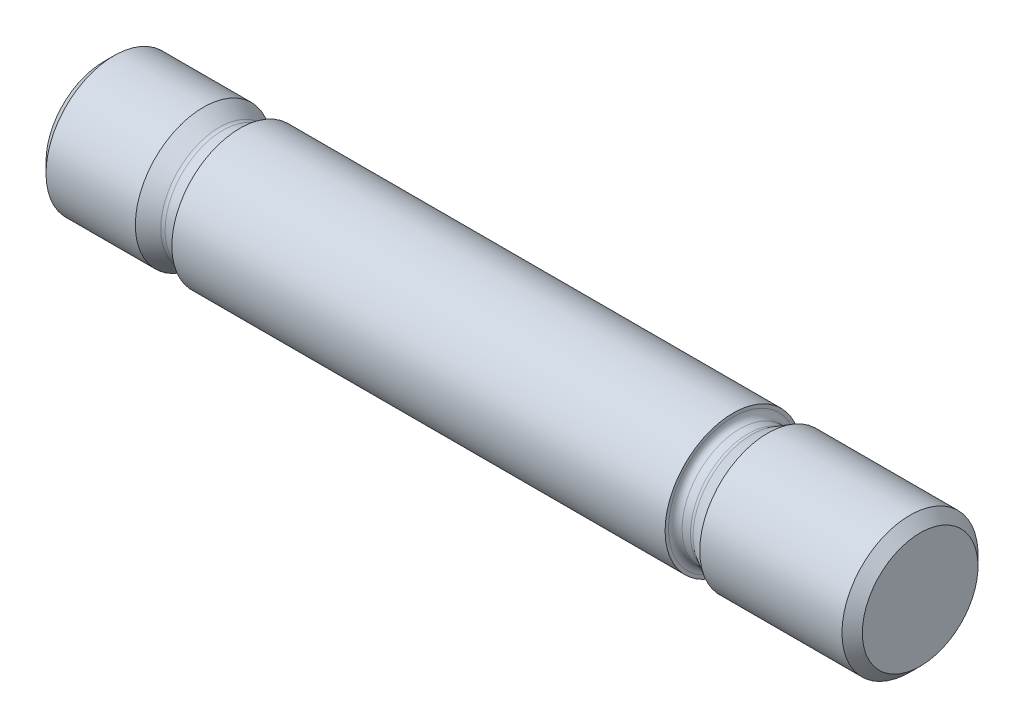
ISO-10303-21;
HEADER;
FILE_DESCRIPTION(('STEP AP214'),'2;1');
FILE_NAME('part.step','',(''),(''),'','','');
FILE_SCHEMA(('AUTOMOTIVE_DESIGN { 1 0 10303 214 1 1 1 1 }'));
ENDSEC;
DATA;
#1=APPLICATION_CONTEXT('core data for automotive mechanical design processes');
#2=APPLICATION_PROTOCOL_DEFINITION('international standard','automotive_design',2000,#1);
#3=PRODUCT_CONTEXT('',#1,'mechanical');
#4=PRODUCT('Part','Part','',(#3));
#5=PRODUCT_RELATED_PRODUCT_CATEGORY('part','',(#4));
#6=PRODUCT_DEFINITION_FORMATION('','',#4);
#7=PRODUCT_DEFINITION_CONTEXT('part definition',#1,'design');
#8=PRODUCT_DEFINITION('design','',#6,#7);
#9=PRODUCT_DEFINITION_SHAPE('','',#8);
#10=(LENGTH_UNIT() NAMED_UNIT(*) SI_UNIT(.MILLI.,.METRE.));
#11=(NAMED_UNIT(*) PLANE_ANGLE_UNIT() SI_UNIT($,.RADIAN.));
#12=(NAMED_UNIT(*) SI_UNIT($,.STERADIAN.) SOLID_ANGLE_UNIT());
#13=UNCERTAINTY_MEASURE_WITH_UNIT(LENGTH_MEASURE(1.E-05),#10,'distance_accuracy_value','');
#14=(GEOMETRIC_REPRESENTATION_CONTEXT(3) GLOBAL_UNCERTAINTY_ASSIGNED_CONTEXT((#13)) GLOBAL_UNIT_ASSIGNED_CONTEXT((#10,
#11,#12)) REPRESENTATION_CONTEXT('',''));
#15=CARTESIAN_POINT('',(0.,0.,0.));
#16=DIRECTION('',(0.,0.,1.));
#17=DIRECTION('',(1.,0.,0.));
#18=AXIS2_PLACEMENT_3D('',#15,#16,#17);
#19=CARTESIAN_POINT('',(0.,8.5,0.));
#20=DIRECTION('',(1.,0.,0.));
#21=DIRECTION('',(0.,0.,-1.));
#22=AXIS2_PLACEMENT_3D('',#19,#20,#21);
#23=PLANE('',#22);
#24=CARTESIAN_POINT('',(0.,0.,0.));
#25=DIRECTION('',(-1.,0.,0.));
#26=DIRECTION('',(0.,0.,1.));
#27=AXIS2_PLACEMENT_3D('',#24,#25,#26);
#28=CIRCLE('',#27,8.5);
#29=CARTESIAN_POINT('',(0.,0.,8.5));
#30=VERTEX_POINT('',#29);
#31=EDGE_CURVE('E89',#30,#30,#28,.T.);
#32=ORIENTED_EDGE('',*,*,#31,.T.);
#33=EDGE_LOOP('',(#32));
#34=FACE_BOUND('',#33,.T.);
#35=ADVANCED_FACE('F37',(#34),#23,.F.);
#36=CARTESIAN_POINT('',(120.,8.5,0.));
#37=DIRECTION('',(1.,0.,0.));
#38=DIRECTION('',(0.,0.,-1.));
#39=AXIS2_PLACEMENT_3D('',#36,#37,#38);
#40=PLANE('',#39);
#41=CARTESIAN_POINT('',(120.,0.,0.));
#42=DIRECTION('',(-1.,0.,0.));
#43=DIRECTION('',(0.,0.,1.));
#44=AXIS2_PLACEMENT_3D('',#41,#42,#43);
#45=CIRCLE('',#44,8.5);
#46=CARTESIAN_POINT('',(120.,0.,8.5));
#47=VERTEX_POINT('',#46);
#48=EDGE_CURVE('E10',#47,#47,#45,.T.);
#49=ORIENTED_EDGE('',*,*,#48,.F.);
#50=EDGE_LOOP('',(#49));
#51=FACE_BOUND('',#50,.T.);
#52=ADVANCED_FACE('F148',(#51),#40,.T.);
#53=CARTESIAN_POINT('',(118.5,0.,0.));
#54=DIRECTION('',(-1.,0.,0.));
#55=DIRECTION('',(0.,0.,1.));
#56=AXIS2_PLACEMENT_3D('',#53,#54,#55);
#57=CONICAL_SURFACE('',#56,10.,0.785398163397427);
#58=ORIENTED_EDGE('',*,*,#48,.T.);
#59=EDGE_LOOP('',(#58));
#60=FACE_BOUND('',#59,.T.);
#61=CARTESIAN_POINT('',(118.5,0.,0.));
#62=DIRECTION('',(-1.,0.,0.));
#63=DIRECTION('',(0.,0.,1.));
#64=AXIS2_PLACEMENT_3D('',#61,#62,#63);
#65=CIRCLE('',#64,10.);
#66=CARTESIAN_POINT('',(118.5,0.,10.));
#67=VERTEX_POINT('',#66);
#68=EDGE_CURVE('E43',#67,#67,#65,.T.);
#69=ORIENTED_EDGE('',*,*,#68,.F.);
#70=EDGE_LOOP('',(#69));
#71=FACE_BOUND('',#70,.T.);
#72=ADVANCED_FACE('F152',(#60,#71),#57,.T.);
#73=CARTESIAN_POINT('',(-3.175,0.,0.));
#74=DIRECTION('',(-1.,0.,0.));
#75=DIRECTION('',(0.,0.,1.));
#76=AXIS2_PLACEMENT_3D('',#73,#74,#75);
#77=CYLINDRICAL_SURFACE('',#76,10.);
#78=ORIENTED_EDGE('',*,*,#68,.T.);
#79=EDGE_LOOP('',(#78));
#80=FACE_BOUND('',#79,.T.);
#81=CARTESIAN_POINT('',(97.6000000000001,0.,0.));
#82=DIRECTION('',(-1.,0.,0.));
#83=DIRECTION('',(0.,0.,1.));
#84=AXIS2_PLACEMENT_3D('',#81,#82,#83);
#85=CIRCLE('',#84,10.);
#86=CARTESIAN_POINT('',(97.6000000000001,0.,10.));
#87=VERTEX_POINT('',#86);
#88=EDGE_CURVE('E47',#87,#87,#85,.T.);
#89=ORIENTED_EDGE('',*,*,#88,.F.);
#90=EDGE_LOOP('',(#89));
#91=FACE_BOUND('',#90,.T.);
#92=ADVANCED_FACE('F157',(#80,#91),#77,.T.);
#93=CARTESIAN_POINT('',(95.2339745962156,0.,0.));
#94=DIRECTION('',(1.,0.,0.));
#95=DIRECTION('',(0.,0.,-1.));
#96=AXIS2_PLACEMENT_3D('',#93,#94,#95);
#97=CONICAL_SURFACE('',#96,8.63397459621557,0.523598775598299);
#98=ORIENTED_EDGE('',*,*,#88,.T.);
#99=EDGE_LOOP('',(#98));
#100=FACE_BOUND('',#99,.T.);
#101=CARTESIAN_POINT('',(95.2339745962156,0.,0.));
#102=DIRECTION('',(-1.,0.,0.));
#103=DIRECTION('',(0.,0.,1.));
#104=AXIS2_PLACEMENT_3D('',#101,#102,#103);
#105=CIRCLE('',#104,8.63397459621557);
#106=CARTESIAN_POINT('',(95.2339745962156,0.,8.63397459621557));
#107=VERTEX_POINT('',#106);
#108=EDGE_CURVE('E51',#107,#107,#105,.T.);
#109=ORIENTED_EDGE('',*,*,#108,.F.);
#110=EDGE_LOOP('',(#109));
#111=FACE_BOUND('',#110,.T.);
#112=ADVANCED_FACE('F162',(#100,#111),#97,.T.);
#113=CARTESIAN_POINT('',(94.7339745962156,0.,0.));
#114=DIRECTION('',(-1.,0.,0.));
#115=DIRECTION('',(0.,0.,1.));
#116=AXIS2_PLACEMENT_3D('',#113,#114,#115);
#117=TOROIDAL_SURFACE('',#116,9.5,0.999999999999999);
#118=ORIENTED_EDGE('',*,*,#108,.T.);
#119=EDGE_LOOP('',(#118));
#120=FACE_BOUND('',#119,.T.);
#121=CARTESIAN_POINT('',(94.7339745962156,0.,0.));
#122=DIRECTION('',(-1.,0.,0.));
#123=DIRECTION('',(0.,0.,1.));
#124=AXIS2_PLACEMENT_3D('',#121,#122,#123);
#125=CIRCLE('',#124,8.5);
#126=CARTESIAN_POINT('',(94.7339745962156,0.,8.5));
#127=VERTEX_POINT('',#126);
#128=EDGE_CURVE('E56',#127,#127,#125,.T.);
#129=ORIENTED_EDGE('',*,*,#128,.F.);
#130=EDGE_LOOP('',(#129));
#131=FACE_BOUND('',#130,.T.);
#132=ADVANCED_FACE('F165',(#120,#131),#117,.F.);
#133=CARTESIAN_POINT('',(-3.175,0.,0.));
#134=DIRECTION('',(-1.,0.,0.));
#135=DIRECTION('',(0.,0.,1.));
#136=AXIS2_PLACEMENT_3D('',#133,#134,#135);
#137=CYLINDRICAL_SURFACE('',#136,8.5);
#138=ORIENTED_EDGE('',*,*,#128,.T.);
#139=EDGE_LOOP('',(#138));
#140=FACE_BOUND('',#139,.T.);
#141=CARTESIAN_POINT('',(93.5019237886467,0.,0.));
#142=DIRECTION('',(-1.,0.,0.));
#143=DIRECTION('',(0.,0.,1.));
#144=AXIS2_PLACEMENT_3D('',#141,#142,#143);
#145=CIRCLE('',#144,8.5);
#146=CARTESIAN_POINT('',(93.5019237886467,0.,8.5));
#147=VERTEX_POINT('',#146);
#148=EDGE_CURVE('E59',#147,#147,#145,.T.);
#149=ORIENTED_EDGE('',*,*,#148,.F.);
#150=EDGE_LOOP('',(#149));
#151=FACE_BOUND('',#150,.T.);
#152=ADVANCED_FACE('F169',(#140,#151),#137,.T.);
#153=CARTESIAN_POINT('',(93.5019237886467,0.,0.));
#154=DIRECTION('',(-1.,0.,0.));
#155=DIRECTION('',(0.,0.,1.));
#156=AXIS2_PLACEMENT_3D('',#153,#154,#155);
#157=TOROIDAL_SURFACE('',#156,9.5,1.00000000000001);
#158=ORIENTED_EDGE('',*,*,#148,.T.);
#159=EDGE_LOOP('',(#158));
#160=FACE_BOUND('',#159,.T.);
#161=CARTESIAN_POINT('',(92.5019237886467,0.,0.));
#162=DIRECTION('',(-1.,0.,0.));
#163=DIRECTION('',(0.,0.,1.));
#164=AXIS2_PLACEMENT_3D('',#161,#162,#163);
#165=CIRCLE('',#164,9.5);
#166=CARTESIAN_POINT('',(92.5019237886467,0.,9.5));
#167=VERTEX_POINT('',#166);
#168=EDGE_CURVE('E62',#167,#167,#165,.T.);
#169=ORIENTED_EDGE('',*,*,#168,.F.);
#170=EDGE_LOOP('',(#169));
#171=FACE_BOUND('',#170,.T.);
#172=ADVANCED_FACE('F144',(#160,#171),#157,.F.);
#173=CARTESIAN_POINT('',(92.5019237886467,10.,0.));
#174=DIRECTION('',(1.,0.,0.));
#175=DIRECTION('',(0.,0.,-1.));
#176=AXIS2_PLACEMENT_3D('',#173,#174,#175);
#177=PLANE('',#176);
#178=ORIENTED_EDGE('',*,*,#168,.T.);
#179=EDGE_LOOP('',(#178));
#180=FACE_BOUND('',#179,.T.);
#181=CARTESIAN_POINT('',(92.5019237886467,0.,0.));
#182=DIRECTION('',(-1.,0.,0.));
#183=DIRECTION('',(0.,0.,1.));
#184=AXIS2_PLACEMENT_3D('',#181,#182,#183);
#185=CIRCLE('',#184,10.);
#186=CARTESIAN_POINT('',(92.5019237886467,0.,10.));
#187=VERTEX_POINT('',#186);
#188=EDGE_CURVE('E65',#187,#187,#185,.T.);
#189=ORIENTED_EDGE('',*,*,#188,.F.);
#190=EDGE_LOOP('',(#189));
#191=FACE_BOUND('',#190,.T.);
#192=ADVANCED_FACE('F138',(#180,#191),#177,.T.);
#193=CARTESIAN_POINT('',(-3.175,0.,0.));
#194=DIRECTION('',(-1.,0.,0.));
#195=DIRECTION('',(0.,0.,1.));
#196=AXIS2_PLACEMENT_3D('',#193,#194,#195);
#197=CYLINDRICAL_SURFACE('',#196,10.);
#198=ORIENTED_EDGE('',*,*,#188,.T.);
#199=EDGE_LOOP('',(#198));
#200=FACE_BOUND('',#199,.T.);
#201=CARTESIAN_POINT('',(20.,0.,0.));
#202=DIRECTION('',(-1.,0.,0.));
#203=DIRECTION('',(0.,0.,1.));
#204=AXIS2_PLACEMENT_3D('',#201,#202,#203);
#205=CIRCLE('',#204,10.);
#206=CARTESIAN_POINT('',(20.,0.,10.));
#207=VERTEX_POINT('',#206);
#208=EDGE_CURVE('E68',#207,#207,#205,.T.);
#209=ORIENTED_EDGE('',*,*,#208,.F.);
#210=EDGE_LOOP('',(#209));
#211=FACE_BOUND('',#210,.T.);
#212=ADVANCED_FACE('F133',(#200,#211),#197,.T.);
#213=CARTESIAN_POINT('',(20.,10.,0.));
#214=DIRECTION('',(1.,0.,0.));
#215=DIRECTION('',(0.,0.,-1.));
#216=AXIS2_PLACEMENT_3D('',#213,#214,#215);
#217=PLANE('',#216);
#218=CARTESIAN_POINT('',(20.,0.,0.));
#219=DIRECTION('',(-1.,0.,0.));
#220=DIRECTION('',(0.,0.,1.));
#221=AXIS2_PLACEMENT_3D('',#218,#219,#220);
#222=CIRCLE('',#221,9.50000000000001);
#223=CARTESIAN_POINT('',(20.,0.,9.50000000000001));
#224=VERTEX_POINT('',#223);
#225=EDGE_CURVE('E71',#224,#224,#222,.T.);
#226=ORIENTED_EDGE('',*,*,#225,.F.);
#227=EDGE_LOOP('',(#226));
#228=FACE_BOUND('',#227,.T.);
#229=ORIENTED_EDGE('',*,*,#208,.T.);
#230=EDGE_LOOP('',(#229));
#231=FACE_BOUND('',#230,.T.);
#232=ADVANCED_FACE('F127',(#228,#231),#217,.F.);
#233=CARTESIAN_POINT('',(19.0000000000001,0.,0.));
#234=DIRECTION('',(-1.,0.,0.));
#235=DIRECTION('',(0.,0.,1.));
#236=AXIS2_PLACEMENT_3D('',#233,#234,#235);
#237=TOROIDAL_SURFACE('',#236,9.5,0.999999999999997);
#238=CARTESIAN_POINT('',(19.0000000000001,0.,0.));
#239=DIRECTION('',(-1.,0.,0.));
#240=DIRECTION('',(0.,0.,1.));
#241=AXIS2_PLACEMENT_3D('',#238,#239,#240);
#242=CIRCLE('',#241,8.50000000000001);
#243=CARTESIAN_POINT('',(19.0000000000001,0.,8.50000000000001));
#244=VERTEX_POINT('',#243);
#245=EDGE_CURVE('E74',#244,#244,#242,.T.);
#246=ORIENTED_EDGE('',*,*,#245,.F.);
#247=EDGE_LOOP('',(#246));
#248=FACE_BOUND('',#247,.T.);
#249=ORIENTED_EDGE('',*,*,#225,.T.);
#250=EDGE_LOOP('',(#249));
#251=FACE_BOUND('',#250,.T.);
#252=ADVANCED_FACE('F121',(#248,#251),#237,.F.);
#253=CARTESIAN_POINT('',(-3.175,0.,0.));
#254=DIRECTION('',(-1.,0.,0.));
#255=DIRECTION('',(0.,0.,1.));
#256=AXIS2_PLACEMENT_3D('',#253,#254,#255);
#257=CYLINDRICAL_SURFACE('',#256,8.5);
#258=CARTESIAN_POINT('',(17.5,0.,0.));
#259=DIRECTION('',(-1.,0.,0.));
#260=DIRECTION('',(0.,0.,1.));
#261=AXIS2_PLACEMENT_3D('',#258,#259,#260);
#262=CIRCLE('',#261,8.5);
#263=CARTESIAN_POINT('',(17.5,0.,8.5));
#264=VERTEX_POINT('',#263);
#265=EDGE_CURVE('E77',#264,#264,#262,.T.);
#266=ORIENTED_EDGE('',*,*,#265,.F.);
#267=EDGE_LOOP('',(#266));
#268=FACE_BOUND('',#267,.T.);
#269=ORIENTED_EDGE('',*,*,#245,.T.);
#270=EDGE_LOOP('',(#269));
#271=FACE_BOUND('',#270,.T.);
#272=ADVANCED_FACE('F115',(#268,#271),#257,.T.);
#273=CARTESIAN_POINT('',(17.5,0.,0.));
#274=DIRECTION('',(-1.,0.,0.));
#275=DIRECTION('',(0.,0.,1.));
#276=AXIS2_PLACEMENT_3D('',#273,#274,#275);
#277=TOROIDAL_SURFACE('',#276,9.5,1.);
#278=CARTESIAN_POINT('',(17.,0.,0.));
#279=DIRECTION('',(-1.,0.,0.));
#280=DIRECTION('',(0.,0.,1.));
#281=AXIS2_PLACEMENT_3D('',#278,#279,#280);
#282=CIRCLE('',#281,8.63397459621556);
#283=CARTESIAN_POINT('',(17.,0.,8.63397459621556));
#284=VERTEX_POINT('',#283);
#285=EDGE_CURVE('E80',#284,#284,#282,.T.);
#286=ORIENTED_EDGE('',*,*,#285,.F.);
#287=EDGE_LOOP('',(#286));
#288=FACE_BOUND('',#287,.T.);
#289=ORIENTED_EDGE('',*,*,#265,.T.);
#290=EDGE_LOOP('',(#289));
#291=FACE_BOUND('',#290,.T.);
#292=ADVANCED_FACE('F109',(#288,#291),#277,.F.);
#293=CARTESIAN_POINT('',(17.,0.,0.));
#294=DIRECTION('',(-1.,0.,0.));
#295=DIRECTION('',(0.,0.,1.));
#296=AXIS2_PLACEMENT_3D('',#293,#294,#295);
#297=CONICAL_SURFACE('',#296,8.63397459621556,0.523598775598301);
#298=CARTESIAN_POINT('',(14.6339745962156,0.,0.));
#299=DIRECTION('',(-1.,0.,0.));
#300=DIRECTION('',(0.,0.,1.));
#301=AXIS2_PLACEMENT_3D('',#298,#299,#300);
#302=CIRCLE('',#301,10.);
#303=CARTESIAN_POINT('',(14.6339745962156,0.,10.));
#304=VERTEX_POINT('',#303);
#305=EDGE_CURVE('E83',#304,#304,#302,.T.);
#306=ORIENTED_EDGE('',*,*,#305,.F.);
#307=EDGE_LOOP('',(#306));
#308=FACE_BOUND('',#307,.T.);
#309=ORIENTED_EDGE('',*,*,#285,.T.);
#310=EDGE_LOOP('',(#309));
#311=FACE_BOUND('',#310,.T.);
#312=ADVANCED_FACE('F103',(#308,#311),#297,.T.);
#313=CARTESIAN_POINT('',(-3.175,0.,0.));
#314=DIRECTION('',(-1.,0.,0.));
#315=DIRECTION('',(0.,0.,1.));
#316=AXIS2_PLACEMENT_3D('',#313,#314,#315);
#317=CYLINDRICAL_SURFACE('',#316,10.);
#318=CARTESIAN_POINT('',(1.49999999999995,0.,0.));
#319=DIRECTION('',(-1.,0.,0.));
#320=DIRECTION('',(0.,0.,1.));
#321=AXIS2_PLACEMENT_3D('',#318,#319,#320);
#322=CIRCLE('',#321,10.);
#323=CARTESIAN_POINT('',(1.49999999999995,0.,10.));
#324=VERTEX_POINT('',#323);
#325=EDGE_CURVE('E86',#324,#324,#322,.T.);
#326=ORIENTED_EDGE('',*,*,#325,.F.);
#327=EDGE_LOOP('',(#326));
#328=FACE_BOUND('',#327,.T.);
#329=ORIENTED_EDGE('',*,*,#305,.T.);
#330=EDGE_LOOP('',(#329));
#331=FACE_BOUND('',#330,.T.);
#332=ADVANCED_FACE('F97',(#328,#331),#317,.T.);
#333=CARTESIAN_POINT('',(1.49999999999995,0.,0.));
#334=DIRECTION('',(1.,0.,0.));
#335=DIRECTION('',(0.,0.,-1.));
#336=AXIS2_PLACEMENT_3D('',#333,#334,#335);
#337=CONICAL_SURFACE('',#336,10.,0.785398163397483);
#338=ORIENTED_EDGE('',*,*,#31,.F.);
#339=EDGE_LOOP('',(#338));
#340=FACE_BOUND('',#339,.T.);
#341=ORIENTED_EDGE('',*,*,#325,.T.);
#342=EDGE_LOOP('',(#341));
#343=FACE_BOUND('',#342,.T.);
#344=ADVANCED_FACE('F94',(#340,#343),#337,.T.);
#345=CLOSED_SHELL('',(#35,#52,#72,#92,#112,#132,#152,#172,#192,#212,#232,#252,#272,#292,#312,
#332,#344));
#346=MANIFOLD_SOLID_BREP('B2',#345);
#347=ADVANCED_BREP_SHAPE_REPRESENTATION('',(#18,#346),#14);
#348=SHAPE_DEFINITION_REPRESENTATION(#9,#347);
ENDSEC;
END-ISO-10303-21;
